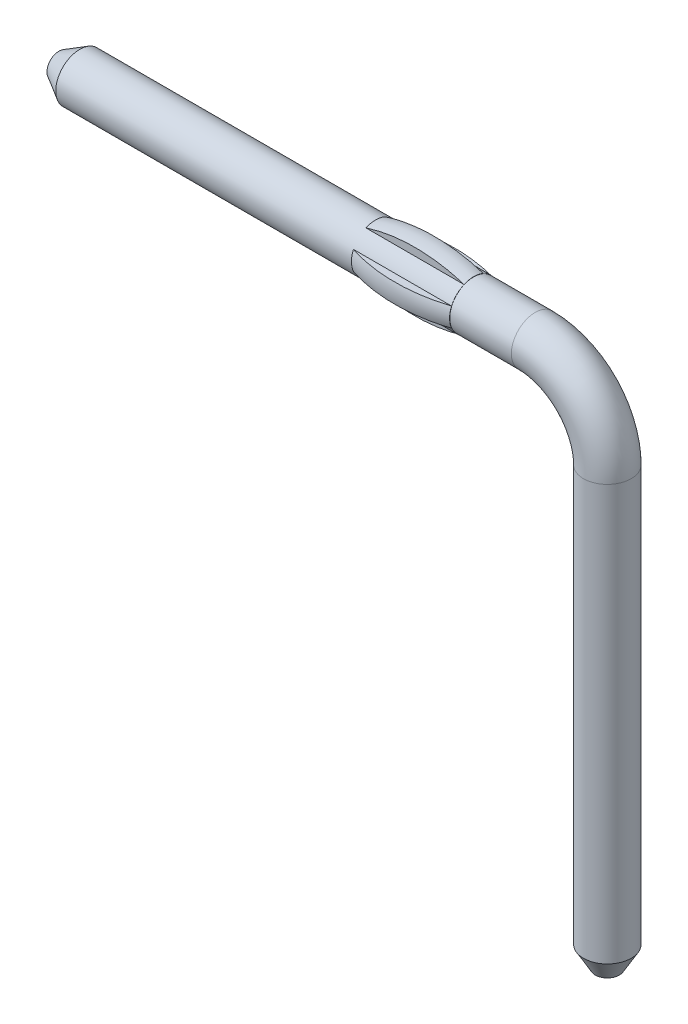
ISO-10303-21;
HEADER;
FILE_DESCRIPTION(('STEP AP214'),'2;1');
FILE_NAME('part.step','',(''),(''),'','','');
FILE_SCHEMA(('AUTOMOTIVE_DESIGN { 1 0 10303 214 1 1 1 1 }'));
ENDSEC;
DATA;
#1=APPLICATION_CONTEXT('core data for automotive mechanical design processes');
#2=APPLICATION_PROTOCOL_DEFINITION('international standard','automotive_design',2000,#1);
#3=PRODUCT_CONTEXT('',#1,'mechanical');
#4=PRODUCT('Part','Part','',(#3));
#5=PRODUCT_RELATED_PRODUCT_CATEGORY('part','',(#4));
#6=PRODUCT_DEFINITION_FORMATION('','',#4);
#7=PRODUCT_DEFINITION_CONTEXT('part definition',#1,'design');
#8=PRODUCT_DEFINITION('design','',#6,#7);
#9=PRODUCT_DEFINITION_SHAPE('','',#8);
#10=(LENGTH_UNIT() NAMED_UNIT(*) SI_UNIT(.MILLI.,.METRE.));
#11=(NAMED_UNIT(*) PLANE_ANGLE_UNIT() SI_UNIT($,.RADIAN.));
#12=(NAMED_UNIT(*) SI_UNIT($,.STERADIAN.) SOLID_ANGLE_UNIT());
#13=UNCERTAINTY_MEASURE_WITH_UNIT(LENGTH_MEASURE(1.E-05),#10,'distance_accuracy_value','');
#14=(GEOMETRIC_REPRESENTATION_CONTEXT(3) GLOBAL_UNCERTAINTY_ASSIGNED_CONTEXT((#13)) GLOBAL_UNIT_ASSIGNED_CONTEXT((#10,
#11,#12)) REPRESENTATION_CONTEXT('',''));
#15=CARTESIAN_POINT('',(0.,0.,0.));
#16=DIRECTION('',(0.,0.,1.));
#17=DIRECTION('',(1.,0.,0.));
#18=AXIS2_PLACEMENT_3D('',#15,#16,#17);
#19=CARTESIAN_POINT('',(-5.7,0.,0.));
#20=DIRECTION('',(1.,0.,0.));
#21=DIRECTION('',(0.,0.,-1.));
#22=AXIS2_PLACEMENT_3D('',#19,#20,#21);
#23=PLANE('',#22);
#24=CARTESIAN_POINT('',(-5.69999999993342,0.,0.));
#25=DIRECTION('',(1.,0.,0.));
#26=DIRECTION('',(0.,0.,-1.));
#27=AXIS2_PLACEMENT_3D('',#24,#25,#26);
#28=CIRCLE('',#27,0.12499999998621);
#29=CARTESIAN_POINT('',(-5.69999999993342,0.,-0.12499999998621));
#30=VERTEX_POINT('',#29);
#31=EDGE_CURVE('E114',#30,#30,#28,.T.);
#32=ORIENTED_EDGE('',*,*,#31,.F.);
#33=EDGE_LOOP('',(#32));
#34=FACE_BOUND('',#33,.T.);
#35=ADVANCED_FACE('F16',(#34),#23,.F.);
#36=CARTESIAN_POINT('',(-5.7,0.1,0.2291287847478));
#37=DIRECTION('',(0.,-1.,0.));
#38=DIRECTION('',(0.,0.,-1.));
#39=AXIS2_PLACEMENT_3D('',#36,#37,#38);
#40=PLANE('',#39);
#41=CARTESIAN_POINT('',(-1.39000000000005,0.1,0.229128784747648));
#42=CARTESIAN_POINT('',(-1.42100227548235,0.1,0.239288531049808));
#43=CARTESIAN_POINT('',(-1.45232127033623,0.1,0.248453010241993));
#44=CARTESIAN_POINT('',(-1.51545487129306,0.1,0.264830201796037));
#45=CARTESIAN_POINT('',(-1.54726930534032,0.1,0.272043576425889));
#46=CARTESIAN_POINT('',(-1.64351825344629,0.1,0.29087085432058));
#47=CARTESIAN_POINT('',(-1.70852693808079,0.1,0.299597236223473));
#48=CARTESIAN_POINT('',(-1.86808650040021,0.1,0.311579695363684));
#49=CARTESIAN_POINT('',(-1.96298668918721,0.1,0.310709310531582));
#50=CARTESIAN_POINT('',(-2.10398407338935,0.1,0.297494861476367));
#51=CARTESIAN_POINT('',(-2.15072624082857,0.1,0.291113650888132));
#52=CARTESIAN_POINT('',(-2.24348691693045,0.1,0.274376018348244));
#53=CARTESIAN_POINT('',(-2.28950587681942,0.1,0.264022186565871));
#54=CARTESIAN_POINT('',(-2.36015911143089,0.1,0.244758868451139));
#55=CARTESIAN_POINT('',(-2.38518518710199,0.1,0.237261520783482));
#56=CARTESIAN_POINT('',(-2.41000000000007,0.1,0.22912878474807));
#57=B_SPLINE_CURVE_WITH_KNOTS('',3,(#41,#42,#43,#44,#45,#46,#47,#48,#49,#50,#51,#52,#53,#54,#55,
#56),.UNSPECIFIED.,.F.,.F.,(4,2,2,2,2,2,2,4),(0.,0.0978417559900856,0.195650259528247,
0.391991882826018,0.675172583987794,0.816569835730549,0.957875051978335,1.03621668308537),.UNSPECIFIED.);
#58=CARTESIAN_POINT('',(-1.39,0.0999999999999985,0.229128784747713));
#59=VERTEX_POINT('',#58);
#60=CARTESIAN_POINT('',(-2.40999999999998,0.0999999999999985,0.229128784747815));
#61=VERTEX_POINT('',#60);
#62=EDGE_CURVE('E240',#59,#61,#57,.T.);
#63=ORIENTED_EDGE('',*,*,#62,.F.);
#64=DIRECTION('',(1.,0.,0.));
#65=VECTOR('',#64,1.);
#66=CARTESIAN_POINT('',(-5.7,0.099999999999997,0.229128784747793));
#67=LINE('',#66,#65);
#68=EDGE_CURVE('E91',#61,#59,#67,.T.);
#69=ORIENTED_EDGE('',*,*,#68,.F.);
#70=EDGE_LOOP('',(#63,#69));
#71=FACE_BOUND('',#70,.T.);
#72=ADVANCED_FACE('F235',(#71),#40,.F.);
#73=CARTESIAN_POINT('',(-5.7,-0.1,0.2291287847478));
#74=DIRECTION('',(0.,-1.,0.));
#75=DIRECTION('',(0.,0.,-1.));
#76=AXIS2_PLACEMENT_3D('',#73,#74,#75);
#77=PLANE('',#76);
#78=DIRECTION('',(1.,0.,0.));
#79=VECTOR('',#78,1.);
#80=CARTESIAN_POINT('',(-5.7,-0.099999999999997,0.229128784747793));
#81=LINE('',#80,#79);
#82=CARTESIAN_POINT('',(-1.39,-0.0999999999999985,0.229128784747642));
#83=VERTEX_POINT('',#82);
#84=CARTESIAN_POINT('',(-2.40999999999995,-0.0999999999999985,0.229128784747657));
#85=VERTEX_POINT('',#84);
#86=EDGE_CURVE('E84',#83,#85,#81,.F.);
#87=ORIENTED_EDGE('',*,*,#86,.F.);
#88=CARTESIAN_POINT('',(-2.40999999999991,-0.1,0.22912878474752));
#89=CARTESIAN_POINT('',(-2.37899772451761,-0.1,0.239288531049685));
#90=CARTESIAN_POINT('',(-2.34767872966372,-0.1,0.248453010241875));
#91=CARTESIAN_POINT('',(-2.28454512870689,-0.1,0.264830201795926));
#92=CARTESIAN_POINT('',(-2.25273069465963,-0.1,0.272043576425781));
#93=CARTESIAN_POINT('',(-2.15648174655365,-0.1,0.290870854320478));
#94=CARTESIAN_POINT('',(-2.09147306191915,-0.1,0.299597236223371));
#95=CARTESIAN_POINT('',(-1.93191349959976,-0.1,0.311579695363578));
#96=CARTESIAN_POINT('',(-1.8370133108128,-0.1,0.310709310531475));
#97=CARTESIAN_POINT('',(-1.6960159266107,-0.1,0.297494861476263));
#98=CARTESIAN_POINT('',(-1.6492737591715,-0.1,0.29111365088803));
#99=CARTESIAN_POINT('',(-1.55651308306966,-0.1,0.274376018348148));
#100=CARTESIAN_POINT('',(-1.51049412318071,-0.1,0.264022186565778));
#101=CARTESIAN_POINT('',(-1.43984088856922,-0.1,0.244758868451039));
#102=CARTESIAN_POINT('',(-1.41481481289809,-0.1,0.237261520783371));
#103=CARTESIAN_POINT('',(-1.38999999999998,-0.1,0.229128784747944));
#104=B_SPLINE_CURVE_WITH_KNOTS('',3,(#88,#89,#90,#91,#92,#93,#94,#95,#96,#97,#98,#99,#100,#101,
#102,#103),.UNSPECIFIED.,.F.,.F.,(4,2,2,2,2,2,2,4),(0.,0.097841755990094,0.195650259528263,
0.391991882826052,0.675172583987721,0.816569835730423,0.957875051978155,1.03621668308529),.UNSPECIFIED.);
#105=EDGE_CURVE('E87',#85,#83,#104,.T.);
#106=ORIENTED_EDGE('',*,*,#105,.F.);
#107=EDGE_LOOP('',(#87,#106));
#108=FACE_BOUND('',#107,.T.);
#109=ADVANCED_FACE('F85',(#108),#77,.T.);
#110=CARTESIAN_POINT('',(-5.7,-0.3092329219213,0.1));
#111=DIRECTION('',(0.,0.,1.));
#112=DIRECTION('',(1.,0.,0.));
#113=AXIS2_PLACEMENT_3D('',#110,#111,#112);
#114=PLANE('',#113);
#115=DIRECTION('',(1.,0.,0.));
#116=VECTOR('',#115,1.);
#117=CARTESIAN_POINT('',(-5.7,-0.229128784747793,0.0999999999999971));
#118=LINE('',#117,#116);
#119=CARTESIAN_POINT('',(-2.40999999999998,-0.229128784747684,0.0999999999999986));
#120=VERTEX_POINT('',#119);
#121=CARTESIAN_POINT('',(-1.39,-0.229128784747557,0.0999999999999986));
#122=VERTEX_POINT('',#121);
#123=EDGE_CURVE('E112',#120,#122,#118,.T.);
#124=ORIENTED_EDGE('',*,*,#123,.F.);
#125=CARTESIAN_POINT('',(-1.39000000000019,-0.229128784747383,0.1));
#126=CARTESIAN_POINT('',(-1.4210022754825,-0.239288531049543,0.1));
#127=CARTESIAN_POINT('',(-1.45232127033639,-0.248453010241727,0.1));
#128=CARTESIAN_POINT('',(-1.51545487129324,-0.264830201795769,0.1));
#129=CARTESIAN_POINT('',(-1.5472693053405,-0.272043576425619,0.1));
#130=CARTESIAN_POINT('',(-1.6435182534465,-0.290870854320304,0.1));
#131=CARTESIAN_POINT('',(-1.70852693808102,-0.29959723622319,0.1));
#132=CARTESIAN_POINT('',(-1.86808650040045,-0.31157969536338,0.1));
#133=CARTESIAN_POINT('',(-1.96298668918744,-0.310709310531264,0.1));
#134=CARTESIAN_POINT('',(-2.10398407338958,-0.29749486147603,0.1));
#135=CARTESIAN_POINT('',(-2.1507262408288,-0.291113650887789,0.1));
#136=CARTESIAN_POINT('',(-2.24348691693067,-0.274376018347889,0.1));
#137=CARTESIAN_POINT('',(-2.28950587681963,-0.264022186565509,0.1));
#138=CARTESIAN_POINT('',(-2.360159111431,-0.244758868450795,0.1));
#139=CARTESIAN_POINT('',(-2.385185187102,-0.237261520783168,0.1));
#140=CARTESIAN_POINT('',(-2.40999999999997,-0.229128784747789,0.1));
#141=B_SPLINE_CURVE_WITH_KNOTS('',3,(#125,#126,#127,#128,#129,#130,#131,#132,#133,#134,#135,
#136,#137,#138,#139,#140),.UNSPECIFIED.,.F.,.F.,(4,2,2,2,2,2,2,4),(0.,0.0978417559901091,
0.195650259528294,0.391991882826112,0.675172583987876,0.816569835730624,0.957875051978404,
1.03621668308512),.UNSPECIFIED.);
#142=EDGE_CURVE('E106',#122,#120,#141,.T.);
#143=ORIENTED_EDGE('',*,*,#142,.F.);
#144=EDGE_LOOP('',(#124,#143));
#145=FACE_BOUND('',#144,.T.);
#146=ADVANCED_FACE('F226',(#145),#114,.T.);
#147=CARTESIAN_POINT('',(-5.7,-0.3092329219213,-0.1));
#148=DIRECTION('',(0.,0.,1.));
#149=DIRECTION('',(1.,0.,0.));
#150=AXIS2_PLACEMENT_3D('',#147,#148,#149);
#151=PLANE('',#150);
#152=CARTESIAN_POINT('',(-2.40999999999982,-0.229128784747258,-0.1));
#153=CARTESIAN_POINT('',(-2.37899772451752,-0.239288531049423,-0.1));
#154=CARTESIAN_POINT('',(-2.34767872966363,-0.248453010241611,-0.1));
#155=CARTESIAN_POINT('',(-2.28454512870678,-0.26483020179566,-0.1));
#156=CARTESIAN_POINT('',(-2.25273069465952,-0.272043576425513,-0.1));
#157=CARTESIAN_POINT('',(-2.15648174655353,-0.290870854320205,-0.1));
#158=CARTESIAN_POINT('',(-2.09147306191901,-0.299597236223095,-0.1));
#159=CARTESIAN_POINT('',(-1.93191349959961,-0.311579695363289,-0.1));
#160=CARTESIAN_POINT('',(-1.83701331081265,-0.310709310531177,-0.1));
#161=CARTESIAN_POINT('',(-1.69601592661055,-0.297494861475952,-0.1));
#162=CARTESIAN_POINT('',(-1.64927375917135,-0.291113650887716,-0.1));
#163=CARTESIAN_POINT('',(-1.55651308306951,-0.274376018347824,-0.1));
#164=CARTESIAN_POINT('',(-1.51049412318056,-0.26402218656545,-0.1));
#165=CARTESIAN_POINT('',(-1.43984088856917,-0.244758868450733,-0.1));
#166=CARTESIAN_POINT('',(-1.41481481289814,-0.237261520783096,-0.1));
#167=CARTESIAN_POINT('',(-1.39000000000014,-0.229128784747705,-0.1));
#168=B_SPLINE_CURVE_WITH_KNOTS('',3,(#152,#153,#154,#155,#156,#157,#158,#159,#160,#161,#162,
#163,#164,#165,#166,#167),.UNSPECIFIED.,.F.,.F.,(4,2,2,2,2,2,2,4),(0.,0.0978417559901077,
0.195650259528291,0.391991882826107,0.675172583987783,0.816569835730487,0.957875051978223,
1.03621668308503),.UNSPECIFIED.);
#169=CARTESIAN_POINT('',(-2.40999999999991,-0.229128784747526,-0.0999999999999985));
#170=VERTEX_POINT('',#169);
#171=CARTESIAN_POINT('',(-1.39000000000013,-0.229128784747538,-0.0999999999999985));
#172=VERTEX_POINT('',#171);
#173=EDGE_CURVE('E183',#170,#172,#168,.T.);
#174=ORIENTED_EDGE('',*,*,#173,.F.);
#175=DIRECTION('',(1.,0.,0.));
#176=VECTOR('',#175,1.);
#177=CARTESIAN_POINT('',(-5.7,-0.229128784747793,-0.0999999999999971));
#178=LINE('',#177,#176);
#179=EDGE_CURVE('E203',#172,#170,#178,.F.);
#180=ORIENTED_EDGE('',*,*,#179,.F.);
#181=EDGE_LOOP('',(#174,#180));
#182=FACE_BOUND('',#181,.T.);
#183=ADVANCED_FACE('F229',(#182),#151,.F.);
#184=CARTESIAN_POINT('',(-5.48349364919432,0.,0.));
#185=DIRECTION('',(1.,0.,0.));
#186=DIRECTION('',(0.,0.,-1.));
#187=AXIS2_PLACEMENT_3D('',#184,#185,#186);
#188=CONICAL_SURFACE('',#187,0.249999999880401,0.523598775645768);
#189=CARTESIAN_POINT('',(-5.483493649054,0.,0.));
#190=DIRECTION('',(1.,0.,0.));
#191=DIRECTION('',(0.,0.,-1.));
#192=AXIS2_PLACEMENT_3D('',#189,#190,#191);
#193=CIRCLE('',#192,0.25);
#194=CARTESIAN_POINT('',(-5.483493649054,0.,-0.25));
#195=VERTEX_POINT('',#194);
#196=EDGE_CURVE('E285',#195,#195,#193,.T.);
#197=ORIENTED_EDGE('',*,*,#196,.F.);
#198=EDGE_LOOP('',(#197));
#199=FACE_BOUND('',#198,.T.);
#200=ORIENTED_EDGE('',*,*,#31,.T.);
#201=EDGE_LOOP('',(#200));
#202=FACE_BOUND('',#201,.T.);
#203=ADVANCED_FACE('F311',(#199,#202),#188,.T.);
#204=CARTESIAN_POINT('',(-5.7,0.1,-0.2291287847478));
#205=DIRECTION('',(0.,1.,0.));
#206=DIRECTION('',(0.,0.,1.));
#207=AXIS2_PLACEMENT_3D('',#204,#205,#206);
#208=PLANE('',#207);
#209=DIRECTION('',(1.,0.,0.));
#210=VECTOR('',#209,1.);
#211=CARTESIAN_POINT('',(-5.7,0.0999999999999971,-0.229128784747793));
#212=LINE('',#211,#210);
#213=CARTESIAN_POINT('',(-1.39000000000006,0.0999999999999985,-0.229128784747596));
#214=VERTEX_POINT('',#213);
#215=CARTESIAN_POINT('',(-2.40999999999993,0.0999999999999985,-0.229128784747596));
#216=VERTEX_POINT('',#215);
#217=EDGE_CURVE('E284',#214,#216,#212,.F.);
#218=ORIENTED_EDGE('',*,*,#217,.F.);
#219=CARTESIAN_POINT('',(-2.40999999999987,0.1,-0.229128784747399));
#220=CARTESIAN_POINT('',(-2.37899772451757,0.1,-0.239288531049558));
#221=CARTESIAN_POINT('',(-2.34767872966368,0.1,-0.248453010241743));
#222=CARTESIAN_POINT('',(-2.28454512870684,0.1,-0.264830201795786));
#223=CARTESIAN_POINT('',(-2.25273069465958,0.1,-0.272043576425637));
#224=CARTESIAN_POINT('',(-2.15648174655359,0.1,-0.290870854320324));
#225=CARTESIAN_POINT('',(-2.09147306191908,0.1,-0.299597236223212));
#226=CARTESIAN_POINT('',(-1.93191349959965,0.1,-0.311579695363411));
#227=CARTESIAN_POINT('',(-1.83701331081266,0.1,-0.310709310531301));
#228=CARTESIAN_POINT('',(-1.69601592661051,0.1,-0.297494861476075));
#229=CARTESIAN_POINT('',(-1.64927375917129,0.1,-0.291113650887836));
#230=CARTESIAN_POINT('',(-1.55651308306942,0.1,-0.274376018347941));
#231=CARTESIAN_POINT('',(-1.51049412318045,0.1,-0.264022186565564));
#232=CARTESIAN_POINT('',(-1.43984088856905,0.1,-0.244758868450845));
#233=CARTESIAN_POINT('',(-1.41481481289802,0.1,-0.23726152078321));
#234=CARTESIAN_POINT('',(-1.39000000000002,0.1,-0.229128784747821));
#235=B_SPLINE_CURVE_WITH_KNOTS('',3,(#219,#220,#221,#222,#223,#224,#225,#226,#227,#228,#229,
#230,#231,#232,#233,#234),.UNSPECIFIED.,.F.,.F.,(4,2,2,2,2,2,2,4),(0.,0.097841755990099,
0.195650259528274,0.391991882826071,0.675172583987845,0.816569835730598,0.957875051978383,
1.0362166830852),.UNSPECIFIED.);
#236=EDGE_CURVE('E198',#216,#214,#235,.T.);
#237=ORIENTED_EDGE('',*,*,#236,.F.);
#238=EDGE_LOOP('',(#218,#237));
#239=FACE_BOUND('',#238,.T.);
#240=ADVANCED_FACE('F171',(#239),#208,.T.);
#241=CARTESIAN_POINT('',(-5.7,-0.1,-0.2291287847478));
#242=DIRECTION('',(0.,1.,0.));
#243=DIRECTION('',(0.,0.,1.));
#244=AXIS2_PLACEMENT_3D('',#241,#242,#243);
#245=PLANE('',#244);
#246=CARTESIAN_POINT('',(-1.38983742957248,-0.1,-0.229075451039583));
#247=CARTESIAN_POINT('',(-1.4208302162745,-0.1,-0.239235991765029));
#248=CARTESIAN_POINT('',(-1.4521397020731,-0.1,-0.248401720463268));
#249=CARTESIAN_POINT('',(-1.51525429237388,-0.1,-0.264782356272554));
#250=CARTESIAN_POINT('',(-1.54705922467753,-0.1,-0.271997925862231));
#251=CARTESIAN_POINT('',(-1.64327948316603,-0.1,-0.290833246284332));
#252=CARTESIAN_POINT('',(-1.70826907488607,-0.1,-0.299566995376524));
#253=CARTESIAN_POINT('',(-1.86780996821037,-0.1,-0.311574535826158));
#254=CARTESIAN_POINT('',(-1.96271147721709,-0.1,-0.310719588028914));
#255=CARTESIAN_POINT('',(-2.10371290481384,-0.1,-0.297527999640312));
#256=CARTESIAN_POINT('',(-2.15045683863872,-0.1,-0.291154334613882));
#257=CARTESIAN_POINT('',(-2.24322173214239,-0.1,-0.274431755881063));
#258=CARTESIAN_POINT('',(-2.28924314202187,-0.1,-0.264085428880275));
#259=CARTESIAN_POINT('',(-2.3599870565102,-0.1,-0.244810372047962));
#260=CARTESIAN_POINT('',(-2.38509987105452,-0.1,-0.237289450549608));
#261=CARTESIAN_POINT('',(-2.40999999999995,-0.1,-0.229128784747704));
#262=B_SPLINE_CURVE_WITH_KNOTS('',3,(#246,#247,#248,#249,#250,#251,#252,#253,#254,#255,#256,
#257,#258,#259,#260,#261),.UNSPECIFIED.,.F.,.F.,(4,2,2,2,2,2,2,4),(0.,0.0978154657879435,
0.195597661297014,0.391885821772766,0.675069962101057,0.81646940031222,0.957776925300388,
1.03638779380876),.UNSPECIFIED.);
#263=CARTESIAN_POINT('',(-1.39000000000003,-0.0997570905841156,-0.228579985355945));
#264=VERTEX_POINT('',#263);
#265=CARTESIAN_POINT('',(-2.40999999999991,-0.0999999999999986,-0.229128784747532));
#266=VERTEX_POINT('',#265);
#267=EDGE_CURVE('E182',#264,#266,#262,.T.);
#268=ORIENTED_EDGE('',*,*,#267,.F.);
#269=DIRECTION('',(1.,0.,0.));
#270=VECTOR('',#269,1.);
#271=CARTESIAN_POINT('',(-5.7,-0.0999999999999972,-0.229128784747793));
#272=LINE('',#271,#270);
#273=EDGE_CURVE('E289',#266,#264,#272,.T.);
#274=ORIENTED_EDGE('',*,*,#273,.F.);
#275=EDGE_LOOP('',(#268,#274));
#276=FACE_BOUND('',#275,.T.);
#277=ADVANCED_FACE('F166',(#276),#245,.F.);
#278=CARTESIAN_POINT('',(-5.7,0.3092329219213,-0.1));
#279=DIRECTION('',(0.,0.,-1.));
#280=DIRECTION('',(-1.,0.,0.));
#281=AXIS2_PLACEMENT_3D('',#278,#279,#280);
#282=PLANE('',#281);
#283=DIRECTION('',(1.,0.,0.));
#284=VECTOR('',#283,1.);
#285=CARTESIAN_POINT('',(-5.7,0.229128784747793,-0.0999999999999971));
#286=LINE('',#285,#284);
#287=CARTESIAN_POINT('',(-2.40999999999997,0.229128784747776,-0.0999999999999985));
#288=VERTEX_POINT('',#287);
#289=CARTESIAN_POINT('',(-1.39000000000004,0.229128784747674,-0.0999999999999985));
#290=VERTEX_POINT('',#289);
#291=EDGE_CURVE('E281',#288,#290,#286,.T.);
#292=ORIENTED_EDGE('',*,*,#291,.F.);
#293=CARTESIAN_POINT('',(-1.39000000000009,0.229128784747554,-0.1));
#294=CARTESIAN_POINT('',(-1.42100227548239,0.239288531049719,-0.1));
#295=CARTESIAN_POINT('',(-1.45232127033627,0.248453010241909,-0.1));
#296=CARTESIAN_POINT('',(-1.51545487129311,0.264830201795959,-0.1));
#297=CARTESIAN_POINT('',(-1.54726930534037,0.272043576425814,-0.1));
#298=CARTESIAN_POINT('',(-1.64351825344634,0.290870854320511,-0.1));
#299=CARTESIAN_POINT('',(-1.70852693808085,0.299597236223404,-0.1));
#300=CARTESIAN_POINT('',(-1.86808650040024,0.311579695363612,-0.1));
#301=CARTESIAN_POINT('',(-1.9629866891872,0.310709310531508,-0.1));
#302=CARTESIAN_POINT('',(-2.1039840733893,0.297494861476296,-0.1));
#303=CARTESIAN_POINT('',(-2.15072624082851,0.291113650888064,-0.1));
#304=CARTESIAN_POINT('',(-2.24348691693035,0.274376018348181,-0.1));
#305=CARTESIAN_POINT('',(-2.2895058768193,0.26402218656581,-0.1));
#306=CARTESIAN_POINT('',(-2.3601591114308,0.244758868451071,-0.1));
#307=CARTESIAN_POINT('',(-2.38518518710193,0.237261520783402,-0.1));
#308=CARTESIAN_POINT('',(-2.41000000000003,0.229128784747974,-0.1));
#309=B_SPLINE_CURVE_WITH_KNOTS('',3,(#293,#294,#295,#296,#297,#298,#299,#300,#301,#302,#303,
#304,#305,#306,#307,#308),.UNSPECIFIED.,.F.,.F.,(4,2,2,2,2,2,2,4),(0.,0.0978417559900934,
0.195650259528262,0.391991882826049,0.675172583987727,0.816569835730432,0.957875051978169,
1.03621668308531),.UNSPECIFIED.);
#310=EDGE_CURVE('E150',#290,#288,#309,.T.);
#311=ORIENTED_EDGE('',*,*,#310,.F.);
#312=EDGE_LOOP('',(#292,#311));
#313=FACE_BOUND('',#312,.T.);
#314=ADVANCED_FACE('F160',(#313),#282,.T.);
#315=CARTESIAN_POINT('',(-5.7,0.3092329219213,0.1));
#316=DIRECTION('',(0.,0.,-1.));
#317=DIRECTION('',(-1.,0.,0.));
#318=AXIS2_PLACEMENT_3D('',#315,#316,#317);
#319=PLANE('',#318);
#320=CARTESIAN_POINT('',(-2.40999999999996,0.229128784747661,0.1));
#321=CARTESIAN_POINT('',(-2.37899772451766,0.239288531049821,0.1));
#322=CARTESIAN_POINT('',(-2.34767872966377,0.248453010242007,0.1));
#323=CARTESIAN_POINT('',(-2.28454512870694,0.264830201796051,0.1));
#324=CARTESIAN_POINT('',(-2.25273069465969,0.272043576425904,0.1));
#325=CARTESIAN_POINT('',(-2.15648174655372,0.290870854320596,0.1));
#326=CARTESIAN_POINT('',(-2.09147306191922,0.299597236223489,0.1));
#327=CARTESIAN_POINT('',(-1.9319134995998,0.311579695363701,0.1));
#328=CARTESIAN_POINT('',(-1.83701331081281,0.310709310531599,0.1));
#329=CARTESIAN_POINT('',(-1.69601592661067,0.297494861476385,0.1));
#330=CARTESIAN_POINT('',(-1.64927375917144,0.291113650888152,0.1));
#331=CARTESIAN_POINT('',(-1.55651308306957,0.274376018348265,0.1));
#332=CARTESIAN_POINT('',(-1.51049412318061,0.264022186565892,0.1));
#333=CARTESIAN_POINT('',(-1.43984088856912,0.244758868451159,0.1));
#334=CARTESIAN_POINT('',(-1.41481481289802,0.2372615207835,0.1));
#335=CARTESIAN_POINT('',(-1.38999999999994,0.229128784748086,0.1));
#336=B_SPLINE_CURVE_WITH_KNOTS('',3,(#320,#321,#322,#323,#324,#325,#326,#327,#328,#329,#330,
#331,#332,#333,#334,#335),.UNSPECIFIED.,.F.,.F.,(4,2,2,2,2,2,2,4),(0.,0.0978417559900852,
0.195650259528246,0.391991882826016,0.675172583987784,0.816569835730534,0.957875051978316,
1.03621668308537),.UNSPECIFIED.);
#337=CARTESIAN_POINT('',(-2.41,0.229128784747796,0.1));
#338=VERTEX_POINT('',#337);
#339=CARTESIAN_POINT('',(-1.39000000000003,0.229128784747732,0.1));
#340=VERTEX_POINT('',#339);
#341=EDGE_CURVE('E102',#338,#340,#336,.T.);
#342=ORIENTED_EDGE('',*,*,#341,.F.);
#343=DIRECTION('',(-1.,0.,0.));
#344=VECTOR('',#343,1.);
#345=CARTESIAN_POINT('',(-5.7,0.2291287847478,0.1));
#346=LINE('',#345,#344);
#347=EDGE_CURVE('E244',#340,#338,#346,.T.);
#348=ORIENTED_EDGE('',*,*,#347,.F.);
#349=EDGE_LOOP('',(#342,#348));
#350=FACE_BOUND('',#349,.T.);
#351=ADVANCED_FACE('F156',(#350),#319,.F.);
#352=CARTESIAN_POINT('',(-1.9,1.62847166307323E-13,1.37693675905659E-13));
#353=DIRECTION('',(1.,0.,0.));
#354=DIRECTION('',(0.,0.,-1.));
#355=AXIS2_PLACEMENT_3D('',#352,#353,#354);
#356=DEGENERATE_TOROIDAL_SURFACE('',#355,1.44649999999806,1.77149999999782,.F.);
#357=ORIENTED_EDGE('',*,*,#105,.T.);
#358=CARTESIAN_POINT('',(-1.39,1.62847166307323E-13,1.37693675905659E-13));
#359=DIRECTION('',(1.,0.,0.));
#360=DIRECTION('',(0.,0.,-1.));
#361=AXIS2_PLACEMENT_3D('',#358,#359,#360);
#362=CIRCLE('',#361,0.249999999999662);
#363=EDGE_CURVE('E94',#59,#83,#362,.T.);
#364=ORIENTED_EDGE('',*,*,#363,.F.);
#365=ORIENTED_EDGE('',*,*,#62,.T.);
#366=CARTESIAN_POINT('',(-2.40999999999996,1.39401294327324E-13,1.10588621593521E-13));
#367=DIRECTION('',(1.,0.,0.));
#368=DIRECTION('',(0.,1.,0.));
#369=AXIS2_PLACEMENT_3D('',#366,#367,#368);
#370=CIRCLE('',#369,0.249999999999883);
#371=EDGE_CURVE('E105',#61,#85,#370,.T.);
#372=ORIENTED_EDGE('',*,*,#371,.T.);
#373=EDGE_LOOP('',(#357,#364,#365,#372));
#374=FACE_BOUND('',#373,.T.);
#375=ADVANCED_FACE('F104',(#374),#356,.F.);
#376=CARTESIAN_POINT('',(-1.9,1.62847166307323E-13,1.37693675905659E-13));
#377=DIRECTION('',(1.,0.,0.));
#378=DIRECTION('',(0.,0.,-1.));
#379=AXIS2_PLACEMENT_3D('',#376,#377,#378);
#380=DEGENERATE_TOROIDAL_SURFACE('',#379,1.44649999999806,1.77149999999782,.F.);
#381=ORIENTED_EDGE('',*,*,#173,.T.);
#382=CARTESIAN_POINT('',(-1.39,1.62847166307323E-13,1.37693675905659E-13));
#383=DIRECTION('',(1.,0.,0.));
#384=DIRECTION('',(0.,0.,-1.));
#385=AXIS2_PLACEMENT_3D('',#382,#383,#384);
#386=CIRCLE('',#385,0.249999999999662);
#387=EDGE_CURVE('E101',#122,#172,#386,.T.);
#388=ORIENTED_EDGE('',*,*,#387,.F.);
#389=ORIENTED_EDGE('',*,*,#142,.T.);
#390=CARTESIAN_POINT('',(-2.41,0.,0.));
#391=DIRECTION('',(1.,0.,0.));
#392=DIRECTION('',(0.,0.,-1.));
#393=AXIS2_PLACEMENT_3D('',#390,#391,#392);
#394=CIRCLE('',#393,0.25);
#395=EDGE_CURVE('E208',#170,#120,#394,.F.);
#396=ORIENTED_EDGE('',*,*,#395,.F.);
#397=EDGE_LOOP('',(#381,#388,#389,#396));
#398=FACE_BOUND('',#397,.T.);
#399=ADVANCED_FACE('F193',(#398),#380,.F.);
#400=CARTESIAN_POINT('',(-1.9,1.62847166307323E-13,1.37693675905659E-13));
#401=DIRECTION('',(1.,0.,0.));
#402=DIRECTION('',(0.,0.,-1.));
#403=AXIS2_PLACEMENT_3D('',#400,#401,#402);
#404=DEGENERATE_TOROIDAL_SURFACE('',#403,1.44649999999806,1.77149999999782,.F.);
#405=ORIENTED_EDGE('',*,*,#236,.T.);
#406=CARTESIAN_POINT('',(-1.39000000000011,1.62847166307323E-13,1.37693675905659E-13));
#407=DIRECTION('',(1.,0.,0.));
#408=DIRECTION('',(0.,0.,-1.));
#409=AXIS2_PLACEMENT_3D('',#406,#407,#408);
#410=CIRCLE('',#409,0.249999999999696);
#411=EDGE_CURVE('E129',#264,#214,#410,.T.);
#412=ORIENTED_EDGE('',*,*,#411,.F.);
#413=ORIENTED_EDGE('',*,*,#267,.T.);
#414=CARTESIAN_POINT('',(-2.41,0.,0.));
#415=DIRECTION('',(1.,0.,0.));
#416=DIRECTION('',(0.,0.,-1.));
#417=AXIS2_PLACEMENT_3D('',#414,#415,#416);
#418=CIRCLE('',#417,0.25);
#419=EDGE_CURVE('E288',#216,#266,#418,.F.);
#420=ORIENTED_EDGE('',*,*,#419,.F.);
#421=EDGE_LOOP('',(#405,#412,#413,#420));
#422=FACE_BOUND('',#421,.T.);
#423=ADVANCED_FACE('F190',(#422),#404,.F.);
#424=CARTESIAN_POINT('',(-5.7,0.,0.));
#425=DIRECTION('',(1.,0.,0.));
#426=DIRECTION('',(0.,0.,-1.));
#427=AXIS2_PLACEMENT_3D('',#424,#425,#426);
#428=CYLINDRICAL_SURFACE('',#427,0.25);
#429=ORIENTED_EDGE('',*,*,#196,.T.);
#430=EDGE_LOOP('',(#429));
#431=FACE_BOUND('',#430,.T.);
#432=ORIENTED_EDGE('',*,*,#273,.T.);
#433=CARTESIAN_POINT('',(-1.39,0.,0.));
#434=DIRECTION('',(1.,0.,0.));
#435=DIRECTION('',(0.,0.,-1.));
#436=AXIS2_PLACEMENT_3D('',#433,#434,#435);
#437=CIRCLE('',#436,0.25);
#438=EDGE_CURVE('E135',#172,#264,#437,.T.);
#439=ORIENTED_EDGE('',*,*,#438,.F.);
#440=ORIENTED_EDGE('',*,*,#179,.T.);
#441=ORIENTED_EDGE('',*,*,#395,.T.);
#442=ORIENTED_EDGE('',*,*,#123,.T.);
#443=CARTESIAN_POINT('',(-1.39,0.,0.));
#444=DIRECTION('',(1.,0.,0.));
#445=DIRECTION('',(0.,0.,-1.));
#446=AXIS2_PLACEMENT_3D('',#443,#444,#445);
#447=CIRCLE('',#446,0.25);
#448=EDGE_CURVE('E79',#122,#83,#447,.F.);
#449=ORIENTED_EDGE('',*,*,#448,.T.);
#450=ORIENTED_EDGE('',*,*,#86,.T.);
#451=ORIENTED_EDGE('',*,*,#371,.F.);
#452=ORIENTED_EDGE('',*,*,#68,.T.);
#453=CARTESIAN_POINT('',(-1.39,0.,0.));
#454=DIRECTION('',(1.,0.,0.));
#455=DIRECTION('',(0.,0.,-1.));
#456=AXIS2_PLACEMENT_3D('',#453,#454,#455);
#457=CIRCLE('',#456,0.25);
#458=EDGE_CURVE('E97',#59,#340,#457,.F.);
#459=ORIENTED_EDGE('',*,*,#458,.T.);
#460=ORIENTED_EDGE('',*,*,#347,.T.);
#461=CARTESIAN_POINT('',(-2.40999999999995,1.38791430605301E-13,1.09816127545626E-13));
#462=DIRECTION('',(1.,0.,0.));
#463=DIRECTION('',(0.,1.,0.));
#464=AXIS2_PLACEMENT_3D('',#461,#462,#463);
#465=CIRCLE('',#464,0.249999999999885);
#466=EDGE_CURVE('E149',#288,#338,#465,.T.);
#467=ORIENTED_EDGE('',*,*,#466,.F.);
#468=ORIENTED_EDGE('',*,*,#291,.T.);
#469=CARTESIAN_POINT('',(-1.39,0.,0.));
#470=DIRECTION('',(1.,0.,0.));
#471=DIRECTION('',(0.,0.,-1.));
#472=AXIS2_PLACEMENT_3D('',#469,#470,#471);
#473=CIRCLE('',#472,0.25);
#474=EDGE_CURVE('E125',#214,#290,#473,.T.);
#475=ORIENTED_EDGE('',*,*,#474,.F.);
#476=ORIENTED_EDGE('',*,*,#217,.T.);
#477=ORIENTED_EDGE('',*,*,#419,.T.);
#478=EDGE_LOOP('',(#432,#439,#440,#441,#442,#449,#450,#451,#452,#459,#460,#467,#468,#475,#476,#477));
#479=FACE_BOUND('',#478,.T.);
#480=ADVANCED_FACE('F110',(#431,#479),#428,.T.);
#481=CARTESIAN_POINT('',(-1.9,1.62847166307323E-13,1.37693675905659E-13));
#482=DIRECTION('',(1.,0.,0.));
#483=DIRECTION('',(0.,0.,-1.));
#484=AXIS2_PLACEMENT_3D('',#481,#482,#483);
#485=DEGENERATE_TOROIDAL_SURFACE('',#484,1.44649999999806,1.77149999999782,.F.);
#486=ORIENTED_EDGE('',*,*,#341,.T.);
#487=CARTESIAN_POINT('',(-1.39,1.62847166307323E-13,1.37693675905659E-13));
#488=DIRECTION('',(1.,0.,0.));
#489=DIRECTION('',(0.,0.,-1.));
#490=AXIS2_PLACEMENT_3D('',#487,#488,#489);
#491=CIRCLE('',#490,0.249999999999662);
#492=EDGE_CURVE('E121',#290,#340,#491,.T.);
#493=ORIENTED_EDGE('',*,*,#492,.F.);
#494=ORIENTED_EDGE('',*,*,#310,.T.);
#495=ORIENTED_EDGE('',*,*,#466,.T.);
#496=EDGE_LOOP('',(#486,#493,#494,#495));
#497=FACE_BOUND('',#496,.T.);
#498=ADVANCED_FACE('F18',(#497),#485,.F.);
#499=CARTESIAN_POINT('',(-1.39,0.,0.));
#500=DIRECTION('',(1.,0.,0.));
#501=DIRECTION('',(0.,0.,-1.));
#502=AXIS2_PLACEMENT_3D('',#499,#500,#501);
#503=PLANE('',#502);
#504=CARTESIAN_POINT('',(-1.39,0.,0.));
#505=DIRECTION('',(1.,0.,0.));
#506=DIRECTION('',(0.,0.,-1.));
#507=AXIS2_PLACEMENT_3D('',#504,#505,#506);
#508=CIRCLE('',#507,0.248);
#509=EDGE_CURVE('E34',#264,#264,#508,.T.);
#510=ORIENTED_EDGE('',*,*,#509,.F.);
#511=ORIENTED_EDGE('',*,*,#411,.T.);
#512=ORIENTED_EDGE('',*,*,#474,.T.);
#513=ORIENTED_EDGE('',*,*,#492,.T.);
#514=ORIENTED_EDGE('',*,*,#458,.F.);
#515=ORIENTED_EDGE('',*,*,#363,.T.);
#516=ORIENTED_EDGE('',*,*,#448,.F.);
#517=ORIENTED_EDGE('',*,*,#387,.T.);
#518=ORIENTED_EDGE('',*,*,#438,.T.);
#519=EDGE_LOOP('',(#510,#511,#512,#513,#514,#515,#516,#517,#518));
#520=FACE_BOUND('',#519,.T.);
#521=ADVANCED_FACE('F95',(#520),#503,.T.);
#522=CARTESIAN_POINT('',(-1.39,0.,0.));
#523=DIRECTION('',(1.,0.,0.));
#524=DIRECTION('',(0.,0.,-1.));
#525=AXIS2_PLACEMENT_3D('',#522,#523,#524);
#526=CYLINDRICAL_SURFACE('',#525,0.248);
#527=CARTESIAN_POINT('',(-0.75,0.,0.));
#528=DIRECTION('',(1.,0.,0.));
#529=DIRECTION('',(0.,1.,0.));
#530=AXIS2_PLACEMENT_3D('',#527,#528,#529);
#531=CIRCLE('',#530,0.248);
#532=CARTESIAN_POINT('',(-0.75,0.248,0.));
#533=VERTEX_POINT('',#532);
#534=EDGE_CURVE('E120',#533,#533,#531,.T.);
#535=ORIENTED_EDGE('',*,*,#534,.F.);
#536=EDGE_LOOP('',(#535));
#537=FACE_BOUND('',#536,.T.);
#538=ORIENTED_EDGE('',*,*,#509,.T.);
#539=EDGE_LOOP('',(#538));
#540=FACE_BOUND('',#539,.T.);
#541=ADVANCED_FACE('F273',(#537,#540),#526,.T.);
#542=CARTESIAN_POINT('',(-0.75,-0.75,0.));
#543=DIRECTION('',(0.,0.,-1.));
#544=DIRECTION('',(0.,-1.,0.));
#545=AXIS2_PLACEMENT_3D('',#542,#543,#544);
#546=TOROIDAL_SURFACE('',#545,0.75,0.248);
#547=CARTESIAN_POINT('',(0.,-0.75,0.));
#548=DIRECTION('',(0.,-1.,0.));
#549=DIRECTION('',(0.,0.,-1.));
#550=AXIS2_PLACEMENT_3D('',#547,#548,#549);
#551=CIRCLE('',#550,0.248);
#552=CARTESIAN_POINT('',(0.,-0.75,-0.248));
#553=VERTEX_POINT('',#552);
#554=EDGE_CURVE('E123',#553,#553,#551,.T.);
#555=ORIENTED_EDGE('',*,*,#554,.F.);
#556=EDGE_LOOP('',(#555));
#557=FACE_BOUND('',#556,.T.);
#558=ORIENTED_EDGE('',*,*,#534,.T.);
#559=EDGE_LOOP('',(#558));
#560=FACE_BOUND('',#559,.T.);
#561=ADVANCED_FACE('F268',(#557,#560),#546,.T.);
#562=CARTESIAN_POINT('',(0.,-5.28,0.));
#563=DIRECTION('',(0.,-1.,0.));
#564=DIRECTION('',(0.,0.,-1.));
#565=AXIS2_PLACEMENT_3D('',#562,#563,#564);
#566=PLANE('',#565);
#567=CARTESIAN_POINT('',(0.,-5.28000000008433,0.));
#568=DIRECTION('',(0.,1.,0.));
#569=DIRECTION('',(0.,0.,1.));
#570=AXIS2_PLACEMENT_3D('',#567,#568,#569);
#571=CIRCLE('',#570,0.124999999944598);
#572=CARTESIAN_POINT('',(0.,-5.28000000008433,0.124999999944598));
#573=VERTEX_POINT('',#572);
#574=EDGE_CURVE('E27',#573,#573,#571,.T.);
#575=ORIENTED_EDGE('',*,*,#574,.F.);
#576=EDGE_LOOP('',(#575));
#577=FACE_BOUND('',#576,.T.);
#578=ADVANCED_FACE('F260',(#577),#566,.T.);
#579=CARTESIAN_POINT('',(0.,-5.06695775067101,0.));
#580=DIRECTION('',(0.,1.,0.));
#581=DIRECTION('',(0.,0.,1.));
#582=AXIS2_PLACEMENT_3D('',#579,#580,#581);
#583=CONICAL_SURFACE('',#582,0.247999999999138,0.52359877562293);
#584=ORIENTED_EDGE('',*,*,#574,.T.);
#585=EDGE_LOOP('',(#584));
#586=FACE_BOUND('',#585,.T.);
#587=CARTESIAN_POINT('',(0.,-5.066957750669,0.));
#588=DIRECTION('',(0.,-1.,0.));
#589=DIRECTION('',(0.,0.,-1.));
#590=AXIS2_PLACEMENT_3D('',#587,#588,#589);
#591=CIRCLE('',#590,0.248);
#592=CARTESIAN_POINT('',(0.,-5.066957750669,-0.248));
#593=VERTEX_POINT('',#592);
#594=EDGE_CURVE('E11',#593,#593,#591,.F.);
#595=ORIENTED_EDGE('',*,*,#594,.F.);
#596=EDGE_LOOP('',(#595));
#597=FACE_BOUND('',#596,.T.);
#598=ADVANCED_FACE('F254',(#586,#597),#583,.T.);
#599=CARTESIAN_POINT('',(0.,-0.75,0.));
#600=DIRECTION('',(0.,-1.,0.));
#601=DIRECTION('',(0.,0.,-1.));
#602=AXIS2_PLACEMENT_3D('',#599,#600,#601);
#603=CYLINDRICAL_SURFACE('',#602,0.248);
#604=ORIENTED_EDGE('',*,*,#554,.T.);
#605=EDGE_LOOP('',(#604));
#606=FACE_BOUND('',#605,.T.);
#607=ORIENTED_EDGE('',*,*,#594,.T.);
#608=EDGE_LOOP('',(#607));
#609=FACE_BOUND('',#608,.T.);
#610=ADVANCED_FACE('F252',(#606,#609),#603,.T.);
#611=CLOSED_SHELL('',(#35,#72,#109,#146,#183,#203,#240,#277,#314,#351,#375,#399,#423,#480,#498,
#521,#541,#561,#578,#598,#610));
#612=MANIFOLD_SOLID_BREP('B1',#611);
#613=ADVANCED_BREP_SHAPE_REPRESENTATION('',(#18,#612),#14);
#614=SHAPE_DEFINITION_REPRESENTATION(#9,#613);
ENDSEC;
END-ISO-10303-21;
